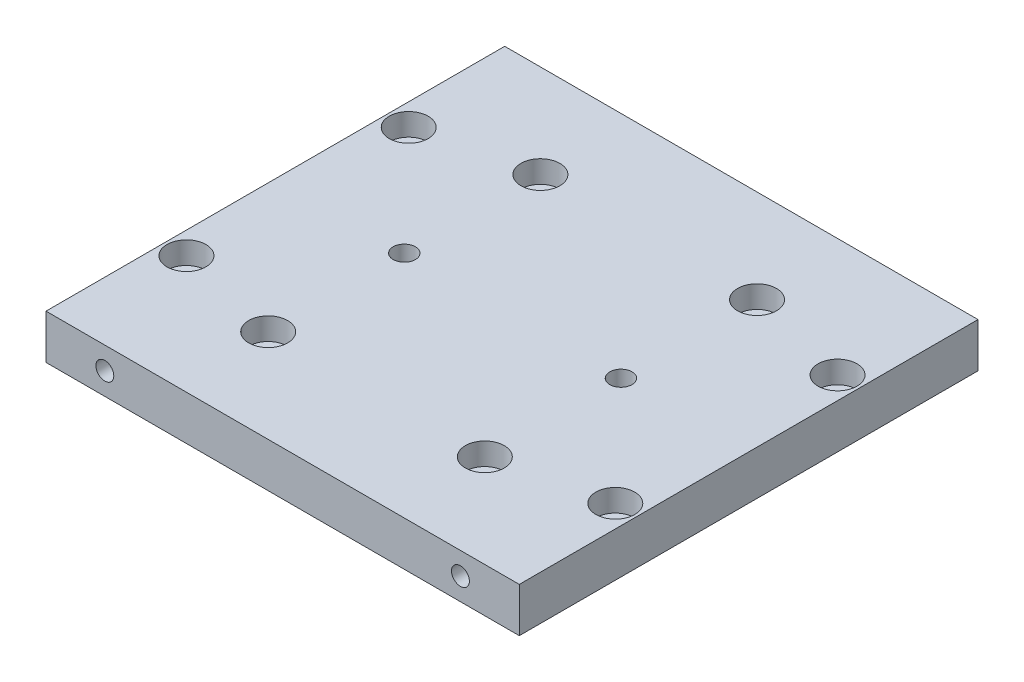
from build123d import *

# Parameters (mm, degrees)
SKETCH1_W                                        = 135.2296
SKETCH1_H                                        = 131.064
BOSS_EXTRUDE1_DEPTH                              = 12.7
CBORE_FOR_1_4_SOCKET_HEAD_CAP_SCREW1_D           = 6.7564
CBORE_FOR_1_4_SOCKET_HEAD_CAP_SCREW1_CBORE_D     = 11.1125
CBORE_FOR_1_4_SOCKET_HEAD_CAP_SCREW1_CBORE_DEPTH = 6.35
F_1_4_0_2500_DOWEL_HOLE1_D                       = 6.35
CBORE_FOR_1_4_SOCKET_HEAD_CAP_SCREW2_D           = 6.7564
CBORE_FOR_1_4_SOCKET_HEAD_CAP_SCREW2_CBORE_D     = 11.1125
CBORE_FOR_1_4_SOCKET_HEAD_CAP_SCREW2_CBORE_DEPTH = 6.35
F_1_4_20_TAPPED_HOLE2_D                          = 5.1054
F_1_4_20_TAPPED_HOLE2_DEPTH                      = 16.51
F_1_4_20_TAPPED_HOLE2_TIP                        = 1.533816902


with BuildPart() as part:
    # Sketch1 → Boss-Extrude1 (new body)
    with BuildSketch(Plane(origin=(0, 0, 0), x_dir=(1, 0, 0), z_dir=(0, 1, 0))):
        Rectangle(SKETCH1_W, SKETCH1_H)
    extrude(amount=BOSS_EXTRUDE1_DEPTH)

    # CBORE for 1_4 Socket Head Cap Screw1 (through all)
    with Locations(Plane(origin=(0, 12.7, 0), x_dir=(1, 0, 0), z_dir=(0, 1, 0))):
        with Locations((31.12294258, -38.887404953), (-30.77685742, -38.887404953), (-30.77685742, 38.887395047), (31.12294258, 38.887395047)):
            CounterBoreHole(CBORE_FOR_1_4_SOCKET_HEAD_CAP_SCREW1_D / 2, CBORE_FOR_1_4_SOCKET_HEAD_CAP_SCREW1_CBORE_D / 2, CBORE_FOR_1_4_SOCKET_HEAD_CAP_SCREW1_CBORE_DEPTH)

    # 1_4 _0.2500_ Dowel Hole1 (through all)
    with Locations(Plane(origin=(0, 12.7, 0), x_dir=(1, 0, 0), z_dir=(0, 1, 0))):
        with Locations((-30.77685742, -4.953e-06), (31.12294258, -4.953e-06)):
            Hole(F_1_4_0_2500_DOWEL_HOLE1_D / 2)

    # CBORE for 1_4 Socket Head Cap Screw2 (through all)
    with Locations(Plane(origin=(0, 12.7, 0), x_dir=(1, 0, 0), z_dir=(0, 1, 0))):
        with Locations((-61.2648, -31.75), (-61.2648, 31.75), (61.2648, -31.75), (61.2648, 31.75)):
            CounterBoreHole(CBORE_FOR_1_4_SOCKET_HEAD_CAP_SCREW2_D / 2, CBORE_FOR_1_4_SOCKET_HEAD_CAP_SCREW2_CBORE_D / 2, CBORE_FOR_1_4_SOCKET_HEAD_CAP_SCREW2_CBORE_DEPTH)

    # 1_4-20 Tapped Hole2
    with Locations(Plane.XY.offset(65.532)):
        with Locations((-50.8, 6.35), (50.8, 6.35)):
            Hole(F_1_4_20_TAPPED_HOLE2_D / 2, depth=F_1_4_20_TAPPED_HOLE2_DEPTH)
            with Locations((0, 0, -(F_1_4_20_TAPPED_HOLE2_DEPTH + F_1_4_20_TAPPED_HOLE2_TIP / 2))):  # 118° drill point
                Cone(0, F_1_4_20_TAPPED_HOLE2_D / 2, F_1_4_20_TAPPED_HOLE2_TIP, mode=Mode.SUBTRACT)


solid = part.part
